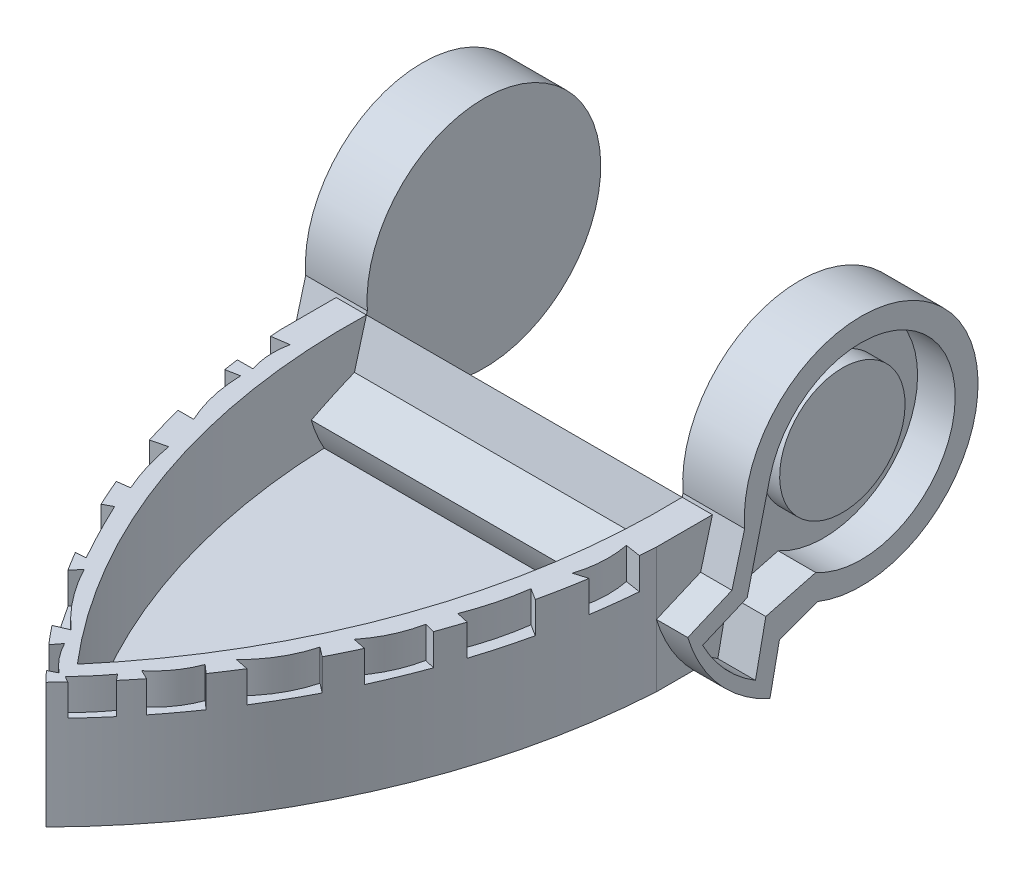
from build123d import *

# Parameters (mm, degrees)
SKETCH1_W                = 152.4
SKETCH1_H                = 50.8
BOSS_EXTRUDE1_DEPTH      = 203.2
CUT_EXTRUDE2_DEPTH       = 66.802
CUT_EXTRUDE3_DEPTH       = 38.1
BOSS_EXTRUDE2_DEPTH      = 12.7
BOSS_EXTRUDE2_DEPTH_BACK = 165.1
CUT_EXTRUDE4_DEPTH       = 86.106
CUT_EXTRUDE4_DEPTH_BACK  = 114.3
SKETCH8_W                = 127.878467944
SKETCH8_H                = 99.509896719
SKETCH9_R                = 38.1
CUT_EXTRUDE5_DEPTH       = 15.24
CUT_EXTRUDE7_START       = -15.24
CUT_EXTRUDE7_DEPTH       = 15.24
SKETCH12_R               = 25.4
BOSS_EXTRUDE3_DEPTH      = 7.62
BOSS_EXTRUDE5_START      = 7.62
SKETCH13_R               = 25.4
BOSS_EXTRUDE5_DEPTH      = 7.62
CUT_EXTRUDE10_DEPTH      = 12.7
SCALE1_SCALE             = 0.75


with BuildPart() as part:
    # Sketch1 → Boss-Extrude1 (new body)
    with BuildSketch(Plane.XY):
        with Locations((76.2, 25.4)):
            Rectangle(SKETCH1_W, SKETCH1_H)
    extrude(amount=BOSS_EXTRUDE1_DEPTH)

    # Sketch5 → Cut-Extrude2 (cut)
    with BuildSketch(Plane(origin=(0, 50.8, 0), x_dir=(1, 0, 0), z_dir=(0, 1, 0))):
        with BuildLine():
            ThreePointArc((76.2, -203.2), (22.587989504, -124.565260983), (0, -32.112826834))
            Line((0, -32.112826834), (0, -203.2))
            Line((0, -203.2), (76.2, -203.2))
        make_face()
        with BuildLine():
            ThreePointArc((152.4, -32.112826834), (129.812010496, -124.565260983), (76.2, -203.2))
            Line((76.2, -203.2), (152.4, -203.2))
            Line((152.4, -203.2), (152.4, -32.112826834))
        make_face()
    extrude(amount=-CUT_EXTRUDE2_DEPTH, mode=Mode.SUBTRACT)

    # Sketch6 → Cut-Extrude3 (cut)
    with BuildSketch(Plane(origin=(0, 50.8, 0), x_dir=(1, 0, 0), z_dir=(0, 1, 0))):
        with BuildLine():
            Line((12.7, 0), (139.7, 0))
            ThreePointArc((139.7, 0), (126.563668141, -101.454556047), (76.2, -190.5))
            ThreePointArc((76.2, -190.5), (25.836331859, -101.454556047), (12.7, 0))
        make_face()
    extrude(amount=-CUT_EXTRUDE3_DEPTH, mode=Mode.SUBTRACT)

    # Sketch7 → Boss-Extrude2 (add, two sides: drawn at the far end of the back side and taken through both)
    with BuildSketch(Plane.ZY.offset(-BOSS_EXTRUDE2_DEPTH_BACK)):
        with BuildLine():
            Line((-1.151882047, -12.7), (-4.9965388, 5.958004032))
            Line((-4.9965388, 5.958004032), (-20.469654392, 11.716718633))
            ThreePointArc((-20.469654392, 11.716718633), (-76.312401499, 83.636185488), (9.094846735, 52.07))
            Line((9.094846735, 52.07), (14.222626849, 33.02))
            Line((14.222626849, 33.02), (32.112826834, 25.4))
            ThreePointArc((32.112826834, 25.4), (19.57971659, 2.770993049), (-1.151882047, -12.7))
        make_face()
    extrude(amount=BOSS_EXTRUDE2_DEPTH + BOSS_EXTRUDE2_DEPTH_BACK)

    # Sketch8 → Cut-Extrude4 (cut, two sides: drawn at the far end of the back side and taken through both)
    with BuildSketch(Plane(origin=(0, 50.8, 0), x_dir=(1, 0, 0), z_dir=(0, 1, 0)).offset(-CUT_EXTRUDE4_DEPTH_BACK)):
        with Locations((76.2, 40.318249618)):
            Rectangle(SKETCH8_W, SKETCH8_H)
    extrude(amount=CUT_EXTRUDE4_DEPTH + CUT_EXTRUDE4_DEPTH_BACK, mode=Mode.SUBTRACT)

    # Sketch9 → Cut-Extrude5 (cut)
    with BuildSketch(Plane.ZY.offset(12.7)):
        with Locations((-38.117801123, 55.653224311)):
            Circle(SKETCH9_R)
        with BuildLine():
            ThreePointArc((-0.269230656, 51.283360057), (-6.481369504, 34.422440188), (-19.730392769, 22.283878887))
            Line((-19.730392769, 22.283878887), (-0.127837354, 13.794138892))
            Line((-0.127837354, 13.794138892), (3.209613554, -2.402410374))
            ThreePointArc((3.209613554, -2.402410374), (15.577657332, 7.986418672), (22.129933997, 22.750020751))
            Line((22.129933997, 22.750020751), (8.266930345, 28.654710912))
            Line((8.266930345, 28.654710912), (-0.017801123, 55.653224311))
            ThreePointArc((-0.017801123, 55.653224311), (-0.080710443, 53.464678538), (-0.269230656, 51.283360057))
        make_face()
    extrude(amount=-CUT_EXTRUDE5_DEPTH, mode=Mode.SUBTRACT)

    # Sketch10 → Cut-Extrude7 (cut)
    with BuildSketch(Plane(origin=(165.1, 0, 0), x_dir=(0, 0, -1), z_dir=(1, 0, 0)).offset(CUT_EXTRUDE7_START)):
        with BuildLine():
            ThreePointArc((19.731967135, 22.283011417), (3.226649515, 40.349056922), (1.114373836, 64.728265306))
            Line((1.114373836, 64.728265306), (-8.048323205, 27.367420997))
            Line((-8.048323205, 27.367420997), (-26.102372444, 19.677632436))
            ThreePointArc((-26.102372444, 19.677632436), (-16.978392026, 6.700674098), (-4.700345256, -3.344127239))
            Line((-4.700345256, -3.344127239), (-0.513218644, 16.975872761))
            Line((-0.513218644, 16.975872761), (19.731967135, 22.283011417))
        make_face()
        with BuildLine():
            ThreePointArc((76.217801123, 55.653224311), (42.688327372, 93.478087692), (1.114373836, 64.728265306))
            ThreePointArc((1.114373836, 64.728265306), (3.226649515, 40.349056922), (19.731967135, 22.283011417))
            ThreePointArc((19.731967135, 22.283011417), (57.497039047, 22.84994494), (76.217801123, 55.653224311))
        make_face()
    extrude(amount=CUT_EXTRUDE7_DEPTH, mode=Mode.SUBTRACT)

    # Sketch12 → Boss-Extrude3 (add)
    with BuildSketch(Plane.ZY.offset(-2.54)):
        with Locations(Location((-38.117801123, 55.653224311, 0), (0, 0, 270))):
            Circle(SKETCH12_R)
    extrude(amount=BOSS_EXTRUDE3_DEPTH)

    # Sketch13 → Boss-Extrude5 (add)
    with BuildSketch(Plane(origin=(149.86, 0, 0), x_dir=(0, 0, -1), z_dir=(1, 0, 0)).offset(BOSS_EXTRUDE5_START)):
        with Locations(Location((38.117801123, 55.653224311, 0), (0, 0, 270))):
            Circle(SKETCH13_R)
    extrude(amount=-BOSS_EXTRUDE5_DEPTH)

    # Sketch18 → Cut-Extrude10 (cut)
    with BuildSketch(Plane(origin=(0, 50.8, 0), x_dir=(1, 0, 0), z_dir=(0, 1, 0))):
        with BuildLine():
            Line((7.208977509, -35.320994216), (-18.44034719, -39.073283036))
            Line((-18.44034719, -39.073283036), (-16.649786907, -51.312922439))
            Line((-16.649786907, -51.312922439), (8.128745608, -51.312922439))
            ThreePointArc((8.128745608, -51.312922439), (6.602915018, -43.378265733), (7.208977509, -35.320994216))
        make_face()
        with BuildLine():
            Line((8.128745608, -56.290808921), (-16.649786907, -60.871211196))
            Line((-16.649786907, -60.871211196), (-12.92109806, -81.042242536))
            Line((-12.92109806, -81.042242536), (13.850919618, -81.042242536))
            ThreePointArc((13.850919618, -81.042242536), (9.700527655, -68.964594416), (8.128745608, -56.290808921))
        make_face()
        with BuildLine():
            Line((18.413523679, -95.674009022), (-8.518951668, -102.576961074))
            Line((-8.518951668, -102.576961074), (-3.619905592, -121.691020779))
            Line((-3.619905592, -121.691020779), (25.129169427, -117.811940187))
            ThreePointArc((25.129169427, -117.811940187), (21.08115325, -106.952347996), (18.413523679, -95.674009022))
        make_face()
        with BuildLine():
            Line((28.46334287, -127.664567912), (4.206256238, -140.525331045))
            Line((4.206256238, -140.525331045), (9.700527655, -153.804821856))
            Line((9.700527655, -153.804821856), (40.672944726, -151.392463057))
            ThreePointArc((40.672944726, -151.392463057), (34.340322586, -139.645744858), (28.46334287, -127.664567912))
        make_face()
        with BuildLine():
            Line((44.375418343, -155.934384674), (28.46334287, -173.500186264))
            Line((28.46334287, -173.500186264), (39.673398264, -189.464170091))
            Line((39.673398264, -189.464170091), (62.895507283, -179.745927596))
            ThreePointArc((62.895507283, -179.745927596), (52.565771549, -168.672138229), (44.375418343, -155.934384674))
        make_face()
        with BuildLine():
            Line((66.355799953, -185.833824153), (55.326297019, -200.215659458))
            Line((55.326297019, -200.215659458), (58.97601705, -205.413142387))
            Line((58.97601705, -205.413142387), (75.558246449, -197.274135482))
            ThreePointArc((75.558246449, -197.274135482), (70.386889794, -192.012588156), (66.355799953, -185.833824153))
        make_face()
        with BuildLine():
            Line((78.011400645, -197.274135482), (90.248931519, -204.157588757))
            Line((90.248931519, -204.157588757), (97.482637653, -197.769538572))
            Line((97.482637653, -197.769538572), (87.848741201, -185.833824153))
            ThreePointArc((87.848741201, -185.833824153), (83.166497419, -191.757279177), (78.011400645, -197.274135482))
        make_face()
        with BuildLine():
            Line((91.540889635, -179.745927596), (105.527112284, -186.463687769))
            Line((105.527112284, -186.463687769), (113.66298891, -174.853738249))
            Line((113.66298891, -174.853738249), (102.187797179, -164.720623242))
            ThreePointArc((102.187797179, -164.720623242), (97.854086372, -172.934605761), (91.540889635, -179.745927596))
        make_face()
        with BuildLine():
            Line((106.833215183, -156.65207574), (123.552741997, -160.066775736))
            Line((123.552741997, -160.066775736), (131.049550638, -144.458592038))
            Line((131.049550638, -144.458592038), (119.356834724, -135.34357016))
            ThreePointArc((119.356834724, -135.34357016), (114.528541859, -146.840341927), (106.833215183, -156.65207574))
        make_face()
        with BuildLine():
            Line((123.552741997, -125.719104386), (138.765667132, -128.82610472))
            Line((138.765667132, -128.82610472), (145.715638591, -109.145856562))
            Line((145.715638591, -109.145856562), (132.772367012, -105.922393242))
            ThreePointArc((132.772367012, -105.922393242), (129.344496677, -116.371196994), (123.552741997, -125.719104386))
        make_face()
        with BuildLine():
            Line((135.501236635, -95.674009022), (147.447988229, -98.346079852))
            Line((147.447988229, -98.346079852), (152.680101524, -79.13747227))
            Line((152.680101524, -79.13747227), (141.603639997, -72.12168833))
            ThreePointArc((141.603639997, -72.12168833), (139.237293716, -84.075294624), (135.501236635, -95.674009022))
        make_face()
        with BuildLine():
            Line((144.519476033, -58.320676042), (155.438477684, -55.084129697))
            Line((155.438477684, -55.084129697), (171.359416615, -41.622752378))
            Line((171.359416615, -41.622752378), (145.715638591, -37.5938415))
            ThreePointArc((145.715638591, -37.5938415), (146.451478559, -48.034240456), (144.519476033, -58.320676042))
        make_face()
    extrude(amount=-CUT_EXTRUDE10_DEPTH, mode=Mode.SUBTRACT)


with BuildPart() as part_1:
    # Scale1: scaled about (76.29548415, 28.774435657, 40.564380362)
    add(part.part.scale(SCALE1_SCALE).moved(Location((19.073871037, 7.193608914, 10.141095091))))


solid = part_1.part
